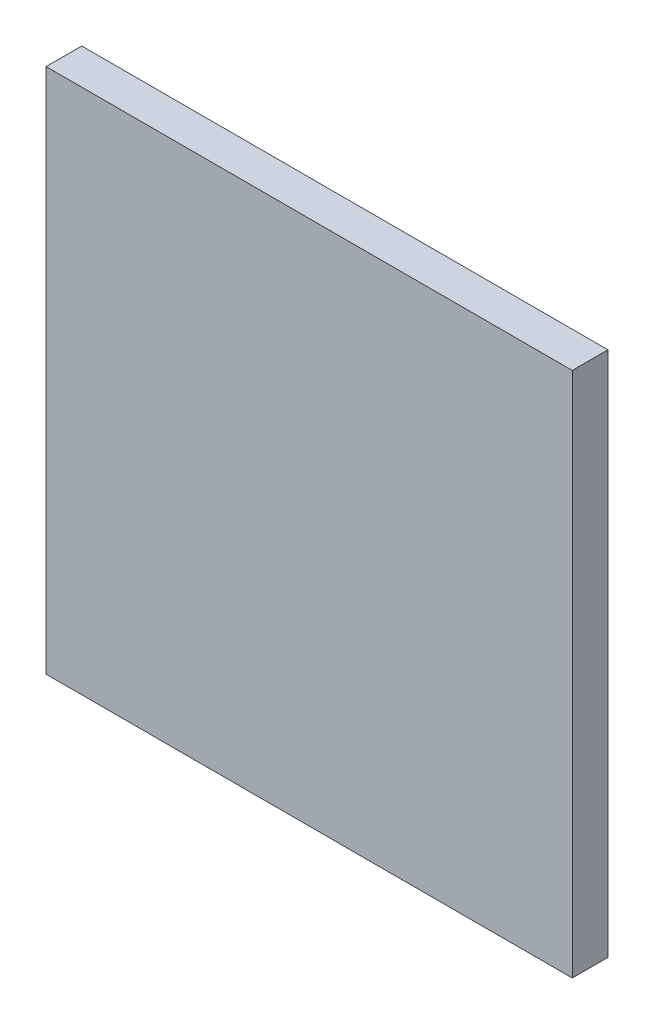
ISO-10303-21;
HEADER;
FILE_DESCRIPTION(('STEP AP214'),'2;1');
FILE_NAME('part.step','',(''),(''),'','','');
FILE_SCHEMA(('AUTOMOTIVE_DESIGN { 1 0 10303 214 1 1 1 1 }'));
ENDSEC;
DATA;
#1=APPLICATION_CONTEXT('core data for automotive mechanical design processes');
#2=APPLICATION_PROTOCOL_DEFINITION('international standard','automotive_design',2000,#1);
#3=PRODUCT_CONTEXT('',#1,'mechanical');
#4=PRODUCT('Part','Part','',(#3));
#5=PRODUCT_RELATED_PRODUCT_CATEGORY('part','',(#4));
#6=PRODUCT_DEFINITION_FORMATION('','',#4);
#7=PRODUCT_DEFINITION_CONTEXT('part definition',#1,'design');
#8=PRODUCT_DEFINITION('design','',#6,#7);
#9=PRODUCT_DEFINITION_SHAPE('','',#8);
#10=(LENGTH_UNIT() NAMED_UNIT(*) SI_UNIT(.MILLI.,.METRE.));
#11=(NAMED_UNIT(*) PLANE_ANGLE_UNIT() SI_UNIT($,.RADIAN.));
#12=(NAMED_UNIT(*) SI_UNIT($,.STERADIAN.) SOLID_ANGLE_UNIT());
#13=UNCERTAINTY_MEASURE_WITH_UNIT(LENGTH_MEASURE(1.E-05),#10,'distance_accuracy_value','');
#14=(GEOMETRIC_REPRESENTATION_CONTEXT(3) GLOBAL_UNCERTAINTY_ASSIGNED_CONTEXT((#13)) GLOBAL_UNIT_ASSIGNED_CONTEXT((#10,
#11,#12)) REPRESENTATION_CONTEXT('',''));
#15=CARTESIAN_POINT('',(0.,0.,0.));
#16=DIRECTION('',(0.,0.,1.));
#17=DIRECTION('',(1.,0.,0.));
#18=AXIS2_PLACEMENT_3D('',#15,#16,#17);
#19=CARTESIAN_POINT('',(-13.4999984,-13.4999984,1.83));
#20=DIRECTION('',(0.,0.,1.));
#21=DIRECTION('',(1.,0.,0.));
#22=AXIS2_PLACEMENT_3D('',#19,#20,#21);
#23=PLANE('',#22);
#24=DIRECTION('',(1.,0.,0.));
#25=VECTOR('',#24,1.);
#26=CARTESIAN_POINT('',(-13.4999984,13.50000094,1.83));
#27=LINE('',#26,#25);
#28=CARTESIAN_POINT('',(-13.4999984,13.50000094,1.83));
#29=VERTEX_POINT('',#28);
#30=CARTESIAN_POINT('',(13.50000094,13.50000094,1.83));
#31=VERTEX_POINT('',#30);
#32=EDGE_CURVE('E53',#29,#31,#27,.T.);
#33=ORIENTED_EDGE('',*,*,#32,.F.);
#34=DIRECTION('',(0.,1.,0.));
#35=VECTOR('',#34,1.);
#36=CARTESIAN_POINT('',(-13.4999984,-13.4999984,1.83));
#37=LINE('',#36,#35);
#38=CARTESIAN_POINT('',(-13.4999984,-13.4999984,1.83));
#39=VERTEX_POINT('',#38);
#40=EDGE_CURVE('E68',#39,#29,#37,.T.);
#41=ORIENTED_EDGE('',*,*,#40,.F.);
#42=DIRECTION('',(1.,0.,0.));
#43=VECTOR('',#42,1.);
#44=CARTESIAN_POINT('',(13.50000094,-13.4999984,1.83));
#45=LINE('',#44,#43);
#46=CARTESIAN_POINT('',(13.50000094,-13.4999984,1.83));
#47=VERTEX_POINT('',#46);
#48=EDGE_CURVE('E20',#47,#39,#45,.F.);
#49=ORIENTED_EDGE('',*,*,#48,.F.);
#50=DIRECTION('',(0.,1.,0.));
#51=VECTOR('',#50,1.);
#52=CARTESIAN_POINT('',(13.50000094,13.50000094,1.83));
#53=LINE('',#52,#51);
#54=EDGE_CURVE('E58',#31,#47,#53,.F.);
#55=ORIENTED_EDGE('',*,*,#54,.F.);
#56=EDGE_LOOP('',(#33,#41,#49,#55));
#57=FACE_BOUND('',#56,.T.);
#58=ADVANCED_FACE('F17',(#57),#23,.T.);
#59=CARTESIAN_POINT('',(13.50000094,-13.4999984,0.));
#60=DIRECTION('',(0.,-1.,0.));
#61=DIRECTION('',(0.,0.,-1.));
#62=AXIS2_PLACEMENT_3D('',#59,#60,#61);
#63=PLANE('',#62);
#64=DIRECTION('',(0.,0.,1.));
#65=VECTOR('',#64,1.);
#66=CARTESIAN_POINT('',(-13.4999984,-13.4999984,0.));
#67=LINE('',#66,#65);
#68=CARTESIAN_POINT('',(-13.4999984,-13.4999984,0.));
#69=VERTEX_POINT('',#68);
#70=EDGE_CURVE('E79',#69,#39,#67,.T.);
#71=ORIENTED_EDGE('',*,*,#70,.F.);
#72=DIRECTION('',(1.,0.,0.));
#73=VECTOR('',#72,1.);
#74=CARTESIAN_POINT('',(-13.4999984,-13.4999984,0.));
#75=LINE('',#74,#73);
#76=CARTESIAN_POINT('',(13.50000094,-13.4999984,0.));
#77=VERTEX_POINT('',#76);
#78=EDGE_CURVE('E74',#69,#77,#75,.T.);
#79=ORIENTED_EDGE('',*,*,#78,.T.);
#80=DIRECTION('',(0.,0.,-1.));
#81=VECTOR('',#80,1.);
#82=CARTESIAN_POINT('',(13.50000094,-13.4999984,0.));
#83=LINE('',#82,#81);
#84=EDGE_CURVE('E63',#47,#77,#83,.T.);
#85=ORIENTED_EDGE('',*,*,#84,.F.);
#86=ORIENTED_EDGE('',*,*,#48,.T.);
#87=EDGE_LOOP('',(#71,#79,#85,#86));
#88=FACE_BOUND('',#87,.T.);
#89=ADVANCED_FACE('F73',(#88),#63,.T.);
#90=CARTESIAN_POINT('',(13.50000094,13.50000094,0.));
#91=DIRECTION('',(1.,0.,0.));
#92=DIRECTION('',(0.,0.,-1.));
#93=AXIS2_PLACEMENT_3D('',#90,#91,#92);
#94=PLANE('',#93);
#95=ORIENTED_EDGE('',*,*,#84,.T.);
#96=DIRECTION('',(0.,1.,0.));
#97=VECTOR('',#96,1.);
#98=CARTESIAN_POINT('',(13.50000094,-13.4999984,0.));
#99=LINE('',#98,#97);
#100=CARTESIAN_POINT('',(13.50000094,13.50000094,0.));
#101=VERTEX_POINT('',#100);
#102=EDGE_CURVE('E84',#77,#101,#99,.T.);
#103=ORIENTED_EDGE('',*,*,#102,.T.);
#104=DIRECTION('',(0.,0.,1.));
#105=VECTOR('',#104,1.);
#106=CARTESIAN_POINT('',(13.50000094,13.50000094,0.));
#107=LINE('',#106,#105);
#108=EDGE_CURVE('E65',#31,#101,#107,.F.);
#109=ORIENTED_EDGE('',*,*,#108,.F.);
#110=ORIENTED_EDGE('',*,*,#54,.T.);
#111=EDGE_LOOP('',(#95,#103,#109,#110));
#112=FACE_BOUND('',#111,.T.);
#113=ADVANCED_FACE('F60',(#112),#94,.T.);
#114=CARTESIAN_POINT('',(-13.4999984,13.50000094,0.));
#115=DIRECTION('',(0.,1.,0.));
#116=DIRECTION('',(0.,0.,1.));
#117=AXIS2_PLACEMENT_3D('',#114,#115,#116);
#118=PLANE('',#117);
#119=ORIENTED_EDGE('',*,*,#108,.T.);
#120=DIRECTION('',(1.,0.,0.));
#121=VECTOR('',#120,1.);
#122=CARTESIAN_POINT('',(-13.4999984,13.50000094,0.));
#123=LINE('',#122,#121);
#124=CARTESIAN_POINT('',(-13.4999984,13.50000094,0.));
#125=VERTEX_POINT('',#124);
#126=EDGE_CURVE('E26',#101,#125,#123,.F.);
#127=ORIENTED_EDGE('',*,*,#126,.T.);
#128=DIRECTION('',(0.,0.,1.));
#129=VECTOR('',#128,1.);
#130=CARTESIAN_POINT('',(-13.4999984,13.50000094,0.));
#131=LINE('',#130,#129);
#132=EDGE_CURVE('E34',#29,#125,#131,.F.);
#133=ORIENTED_EDGE('',*,*,#132,.F.);
#134=ORIENTED_EDGE('',*,*,#32,.T.);
#135=EDGE_LOOP('',(#119,#127,#133,#134));
#136=FACE_BOUND('',#135,.T.);
#137=ADVANCED_FACE('F88',(#136),#118,.T.);
#138=CARTESIAN_POINT('',(-13.4999984,-13.4999984,0.));
#139=DIRECTION('',(-1.,0.,0.));
#140=DIRECTION('',(0.,0.,1.));
#141=AXIS2_PLACEMENT_3D('',#138,#139,#140);
#142=PLANE('',#141);
#143=ORIENTED_EDGE('',*,*,#132,.T.);
#144=DIRECTION('',(0.,1.,0.));
#145=VECTOR('',#144,1.);
#146=CARTESIAN_POINT('',(-13.4999984,-13.4999984,0.));
#147=LINE('',#146,#145);
#148=EDGE_CURVE('E11',#125,#69,#147,.F.);
#149=ORIENTED_EDGE('',*,*,#148,.T.);
#150=ORIENTED_EDGE('',*,*,#70,.T.);
#151=ORIENTED_EDGE('',*,*,#40,.T.);
#152=EDGE_LOOP('',(#143,#149,#150,#151));
#153=FACE_BOUND('',#152,.T.);
#154=ADVANCED_FACE('F91',(#153),#142,.T.);
#155=CARTESIAN_POINT('',(-13.4999984,-13.4999984,0.));
#156=DIRECTION('',(0.,0.,1.));
#157=DIRECTION('',(1.,0.,0.));
#158=AXIS2_PLACEMENT_3D('',#155,#156,#157);
#159=PLANE('',#158);
#160=ORIENTED_EDGE('',*,*,#126,.F.);
#161=ORIENTED_EDGE('',*,*,#102,.F.);
#162=ORIENTED_EDGE('',*,*,#78,.F.);
#163=ORIENTED_EDGE('',*,*,#148,.F.);
#164=EDGE_LOOP('',(#160,#161,#162,#163));
#165=FACE_BOUND('',#164,.T.);
#166=ADVANCED_FACE('F90',(#165),#159,.F.);
#167=CLOSED_SHELL('',(#58,#89,#113,#137,#154,#166));
#168=MANIFOLD_SOLID_BREP('B1',#167);
#169=ADVANCED_BREP_SHAPE_REPRESENTATION('',(#18,#168),#14);
#170=SHAPE_DEFINITION_REPRESENTATION(#9,#169);
ENDSEC;
END-ISO-10303-21;
